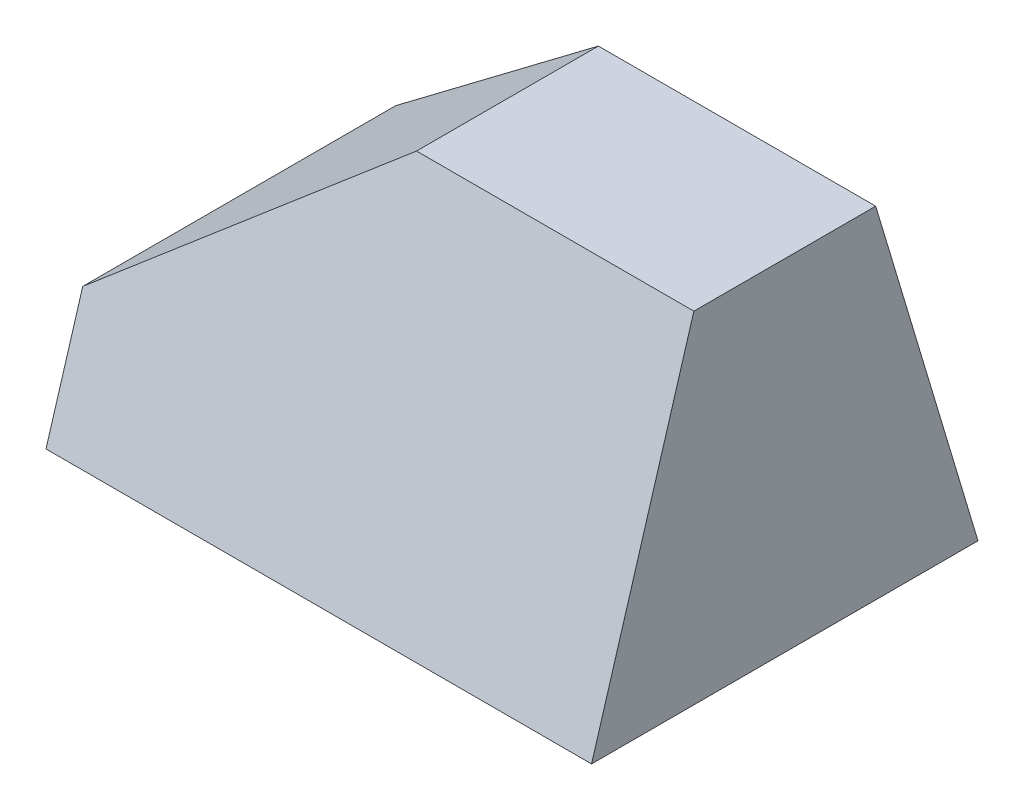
ISO-10303-21;
HEADER;
FILE_DESCRIPTION(('STEP AP214'),'2;1');
FILE_NAME('part.step','',(''),(''),'','','');
FILE_SCHEMA(('AUTOMOTIVE_DESIGN { 1 0 10303 214 1 1 1 1 }'));
ENDSEC;
DATA;
#1=APPLICATION_CONTEXT('core data for automotive mechanical design processes');
#2=APPLICATION_PROTOCOL_DEFINITION('international standard','automotive_design',2000,#1);
#3=PRODUCT_CONTEXT('',#1,'mechanical');
#4=PRODUCT('Part','Part','',(#3));
#5=PRODUCT_RELATED_PRODUCT_CATEGORY('part','',(#4));
#6=PRODUCT_DEFINITION_FORMATION('','',#4);
#7=PRODUCT_DEFINITION_CONTEXT('part definition',#1,'design');
#8=PRODUCT_DEFINITION('design','',#6,#7);
#9=PRODUCT_DEFINITION_SHAPE('','',#8);
#10=(LENGTH_UNIT() NAMED_UNIT(*) SI_UNIT(.MILLI.,.METRE.));
#11=(NAMED_UNIT(*) PLANE_ANGLE_UNIT() SI_UNIT($,.RADIAN.));
#12=(NAMED_UNIT(*) SI_UNIT($,.STERADIAN.) SOLID_ANGLE_UNIT());
#13=UNCERTAINTY_MEASURE_WITH_UNIT(LENGTH_MEASURE(1.E-05),#10,'distance_accuracy_value','');
#14=(GEOMETRIC_REPRESENTATION_CONTEXT(3) GLOBAL_UNCERTAINTY_ASSIGNED_CONTEXT((#13)) GLOBAL_UNIT_ASSIGNED_CONTEXT((#10,
#11,#12)) REPRESENTATION_CONTEXT('',''));
#15=CARTESIAN_POINT('',(0.,0.,0.));
#16=DIRECTION('',(0.,0.,1.));
#17=DIRECTION('',(1.,0.,0.));
#18=AXIS2_PLACEMENT_3D('',#15,#16,#17);
#19=CARTESIAN_POINT('',(120.,75.,20.));
#20=DIRECTION('',(0.,-0.287347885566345,-0.957826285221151));
#21=DIRECTION('',(0.,0.957826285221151,-0.287347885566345));
#22=AXIS2_PLACEMENT_3D('',#19,#20,#21);
#23=PLANE('',#22);
#24=DIRECTION('',(-1.,0.,0.));
#25=VECTOR('',#24,1.);
#26=CARTESIAN_POINT('',(120.,75.,20.));
#27=LINE('',#26,#25);
#28=CARTESIAN_POINT('',(120.,75.,20.));
#29=VERTEX_POINT('',#28);
#30=CARTESIAN_POINT('',(58.998806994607,75.,20.));
#31=VERTEX_POINT('',#30);
#32=EDGE_CURVE('E94',#29,#31,#27,.T.);
#33=ORIENTED_EDGE('',*,*,#32,.T.);
#34=DIRECTION('',(-0.761735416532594,-0.620564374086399,0.18616931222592));
#35=VECTOR('',#34,1.);
#36=CARTESIAN_POINT('',(94.3941907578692,103.835621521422,11.3493135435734));
#37=LINE('',#36,#35);
#38=CARTESIAN_POINT('',(0.,26.9353348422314,34.4193995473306));
#39=VERTEX_POINT('',#38);
#40=EDGE_CURVE('E83',#31,#39,#37,.T.);
#41=ORIENTED_EDGE('',*,*,#40,.T.);
#42=DIRECTION('',(0.,-0.957826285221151,0.287347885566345));
#43=VECTOR('',#42,1.);
#44=CARTESIAN_POINT('',(0.,75.,20.));
#45=LINE('',#44,#43);
#46=CARTESIAN_POINT('',(0.,0.,42.5));
#47=VERTEX_POINT('',#46);
#48=EDGE_CURVE('E92',#39,#47,#45,.T.);
#49=ORIENTED_EDGE('',*,*,#48,.T.);
#50=DIRECTION('',(-1.,0.,0.));
#51=VECTOR('',#50,1.);
#52=CARTESIAN_POINT('',(120.,0.,42.5));
#53=LINE('',#52,#51);
#54=CARTESIAN_POINT('',(120.,0.,42.5));
#55=VERTEX_POINT('',#54);
#56=EDGE_CURVE('E38',#55,#47,#53,.T.);
#57=ORIENTED_EDGE('',*,*,#56,.F.);
#58=DIRECTION('',(0.,-0.957826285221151,0.287347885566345));
#59=VECTOR('',#58,1.);
#60=CARTESIAN_POINT('',(120.,75.,20.));
#61=LINE('',#60,#59);
#62=EDGE_CURVE('E106',#29,#55,#61,.T.);
#63=ORIENTED_EDGE('',*,*,#62,.F.);
#64=EDGE_LOOP('',(#33,#41,#49,#57,#63));
#65=FACE_BOUND('',#64,.T.);
#66=ADVANCED_FACE('F31',(#65),#23,.F.);
#67=CARTESIAN_POINT('',(120.,0.,42.5));
#68=DIRECTION('',(0.,1.,0.));
#69=DIRECTION('',(0.,0.,1.));
#70=AXIS2_PLACEMENT_3D('',#67,#68,#69);
#71=PLANE('',#70);
#72=DIRECTION('',(0.,0.,-1.));
#73=VECTOR('',#72,1.);
#74=CARTESIAN_POINT('',(0.,0.,42.5));
#75=LINE('',#74,#73);
#76=CARTESIAN_POINT('',(0.,0.,-42.5));
#77=VERTEX_POINT('',#76);
#78=EDGE_CURVE('E69',#47,#77,#75,.T.);
#79=ORIENTED_EDGE('',*,*,#78,.T.);
#80=DIRECTION('',(-1.,0.,0.));
#81=VECTOR('',#80,1.);
#82=CARTESIAN_POINT('',(120.,0.,-42.5));
#83=LINE('',#82,#81);
#84=CARTESIAN_POINT('',(120.,0.,-42.5));
#85=VERTEX_POINT('',#84);
#86=EDGE_CURVE('E111',#85,#77,#83,.T.);
#87=ORIENTED_EDGE('',*,*,#86,.F.);
#88=DIRECTION('',(0.,0.,-1.));
#89=VECTOR('',#88,1.);
#90=CARTESIAN_POINT('',(120.,0.,42.5));
#91=LINE('',#90,#89);
#92=EDGE_CURVE('E74',#55,#85,#91,.T.);
#93=ORIENTED_EDGE('',*,*,#92,.F.);
#94=ORIENTED_EDGE('',*,*,#56,.T.);
#95=EDGE_LOOP('',(#79,#87,#93,#94));
#96=FACE_BOUND('',#95,.T.);
#97=ADVANCED_FACE('F112',(#96),#71,.F.);
#98=CARTESIAN_POINT('',(120.,0.,-42.5));
#99=DIRECTION('',(0.,-0.287347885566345,0.957826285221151));
#100=DIRECTION('',(0.,-0.957826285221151,-0.287347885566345));
#101=AXIS2_PLACEMENT_3D('',#98,#99,#100);
#102=PLANE('',#101);
#103=DIRECTION('',(0.,0.957826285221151,0.287347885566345));
#104=VECTOR('',#103,1.);
#105=CARTESIAN_POINT('',(0.,0.,-42.5));
#106=LINE('',#105,#104);
#107=CARTESIAN_POINT('',(0.,26.9353348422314,-34.4193995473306));
#108=VERTEX_POINT('',#107);
#109=EDGE_CURVE('E99',#77,#108,#106,.T.);
#110=ORIENTED_EDGE('',*,*,#109,.T.);
#111=DIRECTION('',(0.761735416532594,0.620564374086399,0.18616931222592));
#112=VECTOR('',#111,1.);
#113=CARTESIAN_POINT('',(55.7504865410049,72.3536848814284,-20.7938945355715));
#114=LINE('',#113,#112);
#115=CARTESIAN_POINT('',(58.998806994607,75.,-20.));
#116=VERTEX_POINT('',#115);
#117=EDGE_CURVE('E45',#108,#116,#114,.T.);
#118=ORIENTED_EDGE('',*,*,#117,.T.);
#119=DIRECTION('',(-1.,0.,0.));
#120=VECTOR('',#119,1.);
#121=CARTESIAN_POINT('',(120.,75.,-20.));
#122=LINE('',#121,#120);
#123=CARTESIAN_POINT('',(120.,75.,-20.));
#124=VERTEX_POINT('',#123);
#125=EDGE_CURVE('E108',#124,#116,#122,.T.);
#126=ORIENTED_EDGE('',*,*,#125,.F.);
#127=DIRECTION('',(0.,0.957826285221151,0.287347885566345));
#128=VECTOR('',#127,1.);
#129=CARTESIAN_POINT('',(120.,0.,-42.5));
#130=LINE('',#129,#128);
#131=EDGE_CURVE('E114',#85,#124,#130,.T.);
#132=ORIENTED_EDGE('',*,*,#131,.F.);
#133=ORIENTED_EDGE('',*,*,#86,.T.);
#134=EDGE_LOOP('',(#110,#118,#126,#132,#133));
#135=FACE_BOUND('',#134,.T.);
#136=ADVANCED_FACE('F120',(#135),#102,.F.);
#137=CARTESIAN_POINT('',(120.,75.,-20.));
#138=DIRECTION('',(0.,-1.,0.));
#139=DIRECTION('',(0.,0.,-1.));
#140=AXIS2_PLACEMENT_3D('',#137,#138,#139);
#141=PLANE('',#140);
#142=ORIENTED_EDGE('',*,*,#125,.T.);
#143=DIRECTION('',(0.,0.,1.));
#144=VECTOR('',#143,1.);
#145=CARTESIAN_POINT('',(58.998806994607,75.,-20.));
#146=LINE('',#145,#144);
#147=EDGE_CURVE('E95',#116,#31,#146,.T.);
#148=ORIENTED_EDGE('',*,*,#147,.T.);
#149=ORIENTED_EDGE('',*,*,#32,.F.);
#150=DIRECTION('',(0.,0.,1.));
#151=VECTOR('',#150,1.);
#152=CARTESIAN_POINT('',(120.,75.,-20.));
#153=LINE('',#152,#151);
#154=EDGE_CURVE('E53',#124,#29,#153,.T.);
#155=ORIENTED_EDGE('',*,*,#154,.F.);
#156=EDGE_LOOP('',(#142,#148,#149,#155));
#157=FACE_BOUND('',#156,.T.);
#158=ADVANCED_FACE('F122',(#157),#141,.F.);
#159=CARTESIAN_POINT('',(120.,0.,42.5));
#160=DIRECTION('',(1.,0.,0.));
#161=DIRECTION('',(0.,0.,-1.));
#162=AXIS2_PLACEMENT_3D('',#159,#160,#161);
#163=PLANE('',#162);
#164=ORIENTED_EDGE('',*,*,#62,.T.);
#165=ORIENTED_EDGE('',*,*,#92,.T.);
#166=ORIENTED_EDGE('',*,*,#131,.T.);
#167=ORIENTED_EDGE('',*,*,#154,.T.);
#168=EDGE_LOOP('',(#164,#165,#166,#167));
#169=FACE_BOUND('',#168,.T.);
#170=ADVANCED_FACE('F118',(#169),#163,.T.);
#171=CARTESIAN_POINT('',(0.,0.,42.5));
#172=DIRECTION('',(1.,0.,0.));
#173=DIRECTION('',(0.,0.,-1.));
#174=AXIS2_PLACEMENT_3D('',#171,#172,#173);
#175=PLANE('',#174);
#176=ORIENTED_EDGE('',*,*,#48,.F.);
#177=DIRECTION('',(0.,0.,-1.));
#178=VECTOR('',#177,1.);
#179=CARTESIAN_POINT('',(0.,26.9353348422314,42.5));
#180=LINE('',#179,#178);
#181=EDGE_CURVE('E11',#39,#108,#180,.T.);
#182=ORIENTED_EDGE('',*,*,#181,.T.);
#183=ORIENTED_EDGE('',*,*,#109,.F.);
#184=ORIENTED_EDGE('',*,*,#78,.F.);
#185=EDGE_LOOP('',(#176,#182,#183,#184));
#186=FACE_BOUND('',#185,.T.);
#187=ADVANCED_FACE('F97',(#186),#175,.F.);
#188=CARTESIAN_POINT('',(70.2620689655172,84.1758620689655,-50.));
#189=DIRECTION('',(0.631606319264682,-0.775289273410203,0.));
#190=DIRECTION('',(0.775289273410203,0.631606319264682,0.));
#191=AXIS2_PLACEMENT_3D('',#188,#189,#190);
#192=PLANE('',#191);
#193=ORIENTED_EDGE('',*,*,#117,.F.);
#194=ORIENTED_EDGE('',*,*,#181,.F.);
#195=ORIENTED_EDGE('',*,*,#40,.F.);
#196=ORIENTED_EDGE('',*,*,#147,.F.);
#197=EDGE_LOOP('',(#193,#194,#195,#196));
#198=FACE_BOUND('',#197,.T.);
#199=ADVANCED_FACE('F82',(#198),#192,.F.);
#200=CLOSED_SHELL('',(#66,#97,#136,#158,#170,#187,#199));
#201=MANIFOLD_SOLID_BREP('B2',#200);
#202=ADVANCED_BREP_SHAPE_REPRESENTATION('',(#18,#201),#14);
#203=SHAPE_DEFINITION_REPRESENTATION(#9,#202);
ENDSEC;
END-ISO-10303-21;
